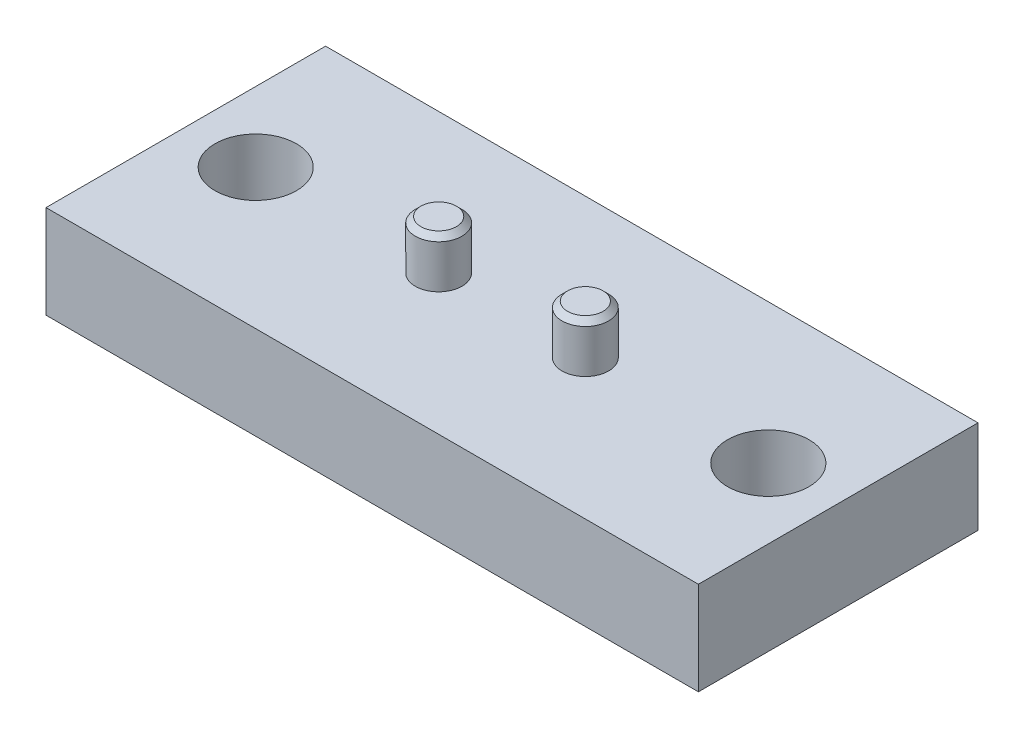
ISO-10303-21;
HEADER;
FILE_DESCRIPTION(('STEP AP214'),'2;1');
FILE_NAME('part.step','',(''),(''),'','','');
FILE_SCHEMA(('AUTOMOTIVE_DESIGN { 1 0 10303 214 1 1 1 1 }'));
ENDSEC;
DATA;
#1=APPLICATION_CONTEXT('core data for automotive mechanical design processes');
#2=APPLICATION_PROTOCOL_DEFINITION('international standard','automotive_design',2000,#1);
#3=PRODUCT_CONTEXT('',#1,'mechanical');
#4=PRODUCT('Part','Part','',(#3));
#5=PRODUCT_RELATED_PRODUCT_CATEGORY('part','',(#4));
#6=PRODUCT_DEFINITION_FORMATION('','',#4);
#7=PRODUCT_DEFINITION_CONTEXT('part definition',#1,'design');
#8=PRODUCT_DEFINITION('design','',#6,#7);
#9=PRODUCT_DEFINITION_SHAPE('','',#8);
#10=(LENGTH_UNIT() NAMED_UNIT(*) SI_UNIT(.MILLI.,.METRE.));
#11=(NAMED_UNIT(*) PLANE_ANGLE_UNIT() SI_UNIT($,.RADIAN.));
#12=(NAMED_UNIT(*) SI_UNIT($,.STERADIAN.) SOLID_ANGLE_UNIT());
#13=UNCERTAINTY_MEASURE_WITH_UNIT(LENGTH_MEASURE(1.E-05),#10,'distance_accuracy_value','');
#14=(GEOMETRIC_REPRESENTATION_CONTEXT(3) GLOBAL_UNCERTAINTY_ASSIGNED_CONTEXT((#13)) GLOBAL_UNIT_ASSIGNED_CONTEXT((#10,
#11,#12)) REPRESENTATION_CONTEXT('',''));
#15=CARTESIAN_POINT('',(0.,0.,0.));
#16=DIRECTION('',(0.,0.,1.));
#17=DIRECTION('',(1.,0.,0.));
#18=AXIS2_PLACEMENT_3D('',#15,#16,#17);
#19=CARTESIAN_POINT('',(-44.45,-12.7,-19.05));
#20=DIRECTION('',(0.,0.,1.));
#21=DIRECTION('',(-1.,0.,0.));
#22=AXIS2_PLACEMENT_3D('',#19,#20,#21);
#23=PLANE('',#22);
#24=DIRECTION('',(1.,0.,0.));
#25=VECTOR('',#24,1.);
#26=CARTESIAN_POINT('',(-44.45,0.,-19.05));
#27=LINE('',#26,#25);
#28=CARTESIAN_POINT('',(-44.45,0.,-19.05));
#29=VERTEX_POINT('',#28);
#30=CARTESIAN_POINT('',(44.45,0.,-19.05));
#31=VERTEX_POINT('',#30);
#32=EDGE_CURVE('E352',#29,#31,#27,.T.);
#33=ORIENTED_EDGE('',*,*,#32,.T.);
#34=DIRECTION('',(0.,1.,0.));
#35=VECTOR('',#34,1.);
#36=CARTESIAN_POINT('',(44.45,-12.7,-19.05));
#37=LINE('',#36,#35);
#38=CARTESIAN_POINT('',(44.45,-12.7,-19.05));
#39=VERTEX_POINT('',#38);
#40=EDGE_CURVE('E370',#39,#31,#37,.T.);
#41=ORIENTED_EDGE('',*,*,#40,.F.);
#42=DIRECTION('',(1.,0.,0.));
#43=VECTOR('',#42,1.);
#44=CARTESIAN_POINT('',(-44.45,-12.7,-19.05));
#45=LINE('',#44,#43);
#46=CARTESIAN_POINT('',(-44.45,-12.7,-19.05));
#47=VERTEX_POINT('',#46);
#48=EDGE_CURVE('E360',#47,#39,#45,.T.);
#49=ORIENTED_EDGE('',*,*,#48,.F.);
#50=DIRECTION('',(0.,1.,0.));
#51=VECTOR('',#50,1.);
#52=CARTESIAN_POINT('',(-44.45,-12.7,-19.05));
#53=LINE('',#52,#51);
#54=EDGE_CURVE('E253',#47,#29,#53,.T.);
#55=ORIENTED_EDGE('',*,*,#54,.T.);
#56=EDGE_LOOP('',(#33,#41,#49,#55));
#57=FACE_BOUND('',#56,.T.);
#58=ADVANCED_FACE('F14',(#57),#23,.F.);
#59=CARTESIAN_POINT('',(44.45,-12.7,19.05));
#60=DIRECTION('',(-1.,0.,0.));
#61=DIRECTION('',(0.,0.,-1.));
#62=AXIS2_PLACEMENT_3D('',#59,#60,#61);
#63=PLANE('',#62);
#64=DIRECTION('',(0.,0.,1.));
#65=VECTOR('',#64,1.);
#66=CARTESIAN_POINT('',(44.45,0.,19.05));
#67=LINE('',#66,#65);
#68=CARTESIAN_POINT('',(44.45,0.,19.05));
#69=VERTEX_POINT('',#68);
#70=EDGE_CURVE('E354',#31,#69,#67,.T.);
#71=ORIENTED_EDGE('',*,*,#70,.T.);
#72=DIRECTION('',(0.,1.,0.));
#73=VECTOR('',#72,1.);
#74=CARTESIAN_POINT('',(44.45,-12.7,19.05));
#75=LINE('',#74,#73);
#76=CARTESIAN_POINT('',(44.45,-12.7,19.05));
#77=VERTEX_POINT('',#76);
#78=EDGE_CURVE('E367',#77,#69,#75,.T.);
#79=ORIENTED_EDGE('',*,*,#78,.F.);
#80=DIRECTION('',(0.,0.,1.));
#81=VECTOR('',#80,1.);
#82=CARTESIAN_POINT('',(44.45,-12.7,19.05));
#83=LINE('',#82,#81);
#84=EDGE_CURVE('E34',#39,#77,#83,.T.);
#85=ORIENTED_EDGE('',*,*,#84,.F.);
#86=ORIENTED_EDGE('',*,*,#40,.T.);
#87=EDGE_LOOP('',(#71,#79,#85,#86));
#88=FACE_BOUND('',#87,.T.);
#89=ADVANCED_FACE('F491',(#88),#63,.F.);
#90=CARTESIAN_POINT('',(-44.45,-12.7,19.05));
#91=DIRECTION('',(0.,0.,-1.));
#92=DIRECTION('',(1.,0.,0.));
#93=AXIS2_PLACEMENT_3D('',#90,#91,#92);
#94=PLANE('',#93);
#95=DIRECTION('',(-1.,0.,0.));
#96=VECTOR('',#95,1.);
#97=CARTESIAN_POINT('',(-44.45,0.,19.05));
#98=LINE('',#97,#96);
#99=CARTESIAN_POINT('',(-44.45,0.,19.05));
#100=VERTEX_POINT('',#99);
#101=EDGE_CURVE('E356',#69,#100,#98,.T.);
#102=ORIENTED_EDGE('',*,*,#101,.T.);
#103=DIRECTION('',(0.,1.,0.));
#104=VECTOR('',#103,1.);
#105=CARTESIAN_POINT('',(-44.45,-12.7,19.05));
#106=LINE('',#105,#104);
#107=CARTESIAN_POINT('',(-44.45,-12.7,19.05));
#108=VERTEX_POINT('',#107);
#109=EDGE_CURVE('E364',#108,#100,#106,.T.);
#110=ORIENTED_EDGE('',*,*,#109,.F.);
#111=DIRECTION('',(-1.,0.,0.));
#112=VECTOR('',#111,1.);
#113=CARTESIAN_POINT('',(-44.45,-12.7,19.05));
#114=LINE('',#113,#112);
#115=EDGE_CURVE('E29',#77,#108,#114,.T.);
#116=ORIENTED_EDGE('',*,*,#115,.F.);
#117=ORIENTED_EDGE('',*,*,#78,.T.);
#118=EDGE_LOOP('',(#102,#110,#116,#117));
#119=FACE_BOUND('',#118,.T.);
#120=ADVANCED_FACE('F488',(#119),#94,.F.);
#121=CARTESIAN_POINT('',(-44.45,-12.7,19.05));
#122=DIRECTION('',(1.,0.,0.));
#123=DIRECTION('',(0.,0.,1.));
#124=AXIS2_PLACEMENT_3D('',#121,#122,#123);
#125=PLANE('',#124);
#126=DIRECTION('',(0.,0.,-1.));
#127=VECTOR('',#126,1.);
#128=CARTESIAN_POINT('',(-44.45,0.,19.05));
#129=LINE('',#128,#127);
#130=EDGE_CURVE('E349',#100,#29,#129,.T.);
#131=ORIENTED_EDGE('',*,*,#130,.T.);
#132=ORIENTED_EDGE('',*,*,#54,.F.);
#133=DIRECTION('',(0.,0.,-1.));
#134=VECTOR('',#133,1.);
#135=CARTESIAN_POINT('',(-44.45,-12.7,19.05));
#136=LINE('',#135,#134);
#137=EDGE_CURVE('E358',#108,#47,#136,.T.);
#138=ORIENTED_EDGE('',*,*,#137,.F.);
#139=ORIENTED_EDGE('',*,*,#109,.T.);
#140=EDGE_LOOP('',(#131,#132,#138,#139));
#141=FACE_BOUND('',#140,.T.);
#142=ADVANCED_FACE('F16',(#141),#125,.F.);
#143=CARTESIAN_POINT('',(34.925,-12.7,0.));
#144=DIRECTION('',(0.,-1.,0.));
#145=DIRECTION('',(0.,0.,-1.));
#146=AXIS2_PLACEMENT_3D('',#143,#144,#145);
#147=CYLINDRICAL_SURFACE('',#146,5.5499);
#148=CARTESIAN_POINT('',(34.925,0.,0.));
#149=DIRECTION('',(0.,-1.,0.));
#150=DIRECTION('',(0.,0.,-1.));
#151=AXIS2_PLACEMENT_3D('',#148,#149,#150);
#152=CIRCLE('',#151,5.5499);
#153=CARTESIAN_POINT('',(34.925,0.,-5.54990000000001));
#154=VERTEX_POINT('',#153);
#155=EDGE_CURVE('E340',#154,#154,#152,.T.);
#156=ORIENTED_EDGE('',*,*,#155,.F.);
#157=EDGE_LOOP('',(#156));
#158=FACE_BOUND('',#157,.T.);
#159=CARTESIAN_POINT('',(34.925,-12.7,0.));
#160=DIRECTION('',(0.,-1.,0.));
#161=DIRECTION('',(0.,0.,-1.));
#162=AXIS2_PLACEMENT_3D('',#159,#160,#161);
#163=CIRCLE('',#162,5.5499);
#164=CARTESIAN_POINT('',(34.925,-12.7,-5.54990000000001));
#165=VERTEX_POINT('',#164);
#166=EDGE_CURVE('E337',#165,#165,#163,.T.);
#167=ORIENTED_EDGE('',*,*,#166,.T.);
#168=EDGE_LOOP('',(#167));
#169=FACE_BOUND('',#168,.T.);
#170=ADVANCED_FACE('F469',(#158,#169),#147,.F.);
#171=CARTESIAN_POINT('',(-34.925,-12.7,0.));
#172=DIRECTION('',(0.,-1.,0.));
#173=DIRECTION('',(0.,0.,-1.));
#174=AXIS2_PLACEMENT_3D('',#171,#172,#173);
#175=CYLINDRICAL_SURFACE('',#174,5.5499);
#176=CARTESIAN_POINT('',(-34.925,0.,0.));
#177=DIRECTION('',(0.,-1.,0.));
#178=DIRECTION('',(0.,0.,-1.));
#179=AXIS2_PLACEMENT_3D('',#176,#177,#178);
#180=CIRCLE('',#179,5.5499);
#181=CARTESIAN_POINT('',(-34.925,0.,-5.54989999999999));
#182=VERTEX_POINT('',#181);
#183=EDGE_CURVE('E334',#182,#182,#180,.T.);
#184=ORIENTED_EDGE('',*,*,#183,.F.);
#185=EDGE_LOOP('',(#184));
#186=FACE_BOUND('',#185,.T.);
#187=CARTESIAN_POINT('',(-34.925,-12.7,0.));
#188=DIRECTION('',(0.,-1.,0.));
#189=DIRECTION('',(0.,0.,-1.));
#190=AXIS2_PLACEMENT_3D('',#187,#188,#189);
#191=CIRCLE('',#190,5.5499);
#192=CARTESIAN_POINT('',(-34.925,-12.7,-5.54989999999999));
#193=VERTEX_POINT('',#192);
#194=EDGE_CURVE('E331',#193,#193,#191,.T.);
#195=ORIENTED_EDGE('',*,*,#194,.T.);
#196=EDGE_LOOP('',(#195));
#197=FACE_BOUND('',#196,.T.);
#198=ADVANCED_FACE('F466',(#186,#197),#175,.F.);
#199=CARTESIAN_POINT('',(-44.45,0.,19.05));
#200=DIRECTION('',(0.,-1.,0.));
#201=DIRECTION('',(0.,0.,-1.));
#202=AXIS2_PLACEMENT_3D('',#199,#200,#201);
#203=PLANE('',#202);
#204=CARTESIAN_POINT('',(9.9949,0.,0.));
#205=DIRECTION('',(0.,-1.,0.));
#206=DIRECTION('',(1.,0.,0.));
#207=AXIS2_PLACEMENT_3D('',#204,#205,#206);
#208=CIRCLE('',#207,3.175);
#209=CARTESIAN_POINT('',(13.1699,0.,0.));
#210=VERTEX_POINT('',#209);
#211=EDGE_CURVE('E9',#210,#210,#208,.T.);
#212=ORIENTED_EDGE('',*,*,#211,.T.);
#213=EDGE_LOOP('',(#212));
#214=FACE_BOUND('',#213,.T.);
#215=CARTESIAN_POINT('',(-9.9949,0.,0.));
#216=DIRECTION('',(0.,-1.,0.));
#217=DIRECTION('',(1.,0.,0.));
#218=AXIS2_PLACEMENT_3D('',#215,#216,#217);
#219=CIRCLE('',#218,3.175);
#220=CARTESIAN_POINT('',(-6.8199,0.,0.));
#221=VERTEX_POINT('',#220);
#222=EDGE_CURVE('E22',#221,#221,#219,.T.);
#223=ORIENTED_EDGE('',*,*,#222,.T.);
#224=EDGE_LOOP('',(#223));
#225=FACE_BOUND('',#224,.T.);
#226=ORIENTED_EDGE('',*,*,#183,.T.);
#227=EDGE_LOOP('',(#226));
#228=FACE_BOUND('',#227,.T.);
#229=ORIENTED_EDGE('',*,*,#155,.T.);
#230=EDGE_LOOP('',(#229));
#231=FACE_BOUND('',#230,.T.);
#232=ORIENTED_EDGE('',*,*,#130,.F.);
#233=ORIENTED_EDGE('',*,*,#101,.F.);
#234=ORIENTED_EDGE('',*,*,#70,.F.);
#235=ORIENTED_EDGE('',*,*,#32,.F.);
#236=EDGE_LOOP('',(#232,#233,#234,#235));
#237=FACE_BOUND('',#236,.T.);
#238=ADVANCED_FACE('F377',(#214,#225,#228,#231,#237),#203,.F.);
#239=CARTESIAN_POINT('',(-44.45,-12.7,19.05));
#240=DIRECTION('',(0.,-1.,0.));
#241=DIRECTION('',(0.,0.,-1.));
#242=AXIS2_PLACEMENT_3D('',#239,#240,#241);
#243=PLANE('',#242);
#244=ORIENTED_EDGE('',*,*,#194,.F.);
#245=EDGE_LOOP('',(#244));
#246=FACE_BOUND('',#245,.T.);
#247=ORIENTED_EDGE('',*,*,#166,.F.);
#248=EDGE_LOOP('',(#247));
#249=FACE_BOUND('',#248,.T.);
#250=CARTESIAN_POINT('',(-9.9949,-12.7,0.));
#251=DIRECTION('',(0.,-1.,0.));
#252=DIRECTION('',(0.,0.,-1.));
#253=AXIS2_PLACEMENT_3D('',#250,#251,#252);
#254=CIRCLE('',#253,7.1247);
#255=CARTESIAN_POINT('',(-9.9949,-12.7,-7.1247));
#256=VERTEX_POINT('',#255);
#257=EDGE_CURVE('E343',#256,#256,#254,.T.);
#258=ORIENTED_EDGE('',*,*,#257,.F.);
#259=EDGE_LOOP('',(#258));
#260=FACE_BOUND('',#259,.T.);
#261=CARTESIAN_POINT('',(9.9949,-12.7,0.));
#262=DIRECTION('',(0.,-1.,0.));
#263=DIRECTION('',(0.,0.,-1.));
#264=AXIS2_PLACEMENT_3D('',#261,#262,#263);
#265=CIRCLE('',#264,7.1247);
#266=CARTESIAN_POINT('',(9.9949,-12.7,-7.1247));
#267=VERTEX_POINT('',#266);
#268=EDGE_CURVE('E346',#267,#267,#265,.T.);
#269=ORIENTED_EDGE('',*,*,#268,.F.);
#270=EDGE_LOOP('',(#269));
#271=FACE_BOUND('',#270,.T.);
#272=ORIENTED_EDGE('',*,*,#137,.T.);
#273=ORIENTED_EDGE('',*,*,#48,.T.);
#274=ORIENTED_EDGE('',*,*,#84,.T.);
#275=ORIENTED_EDGE('',*,*,#115,.T.);
#276=EDGE_LOOP('',(#272,#273,#274,#275));
#277=FACE_BOUND('',#276,.T.);
#278=ADVANCED_FACE('F477',(#246,#249,#260,#271,#277),#243,.T.);
#279=CARTESIAN_POINT('',(-9.9949,-12.7,0.));
#280=DIRECTION('',(0.,-1.,0.));
#281=DIRECTION('',(0.,0.,-1.));
#282=AXIS2_PLACEMENT_3D('',#279,#280,#281);
#283=CONICAL_SURFACE('',#282,7.1247,0.715584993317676);
#284=ORIENTED_EDGE('',*,*,#257,.T.);
#285=EDGE_LOOP('',(#284));
#286=FACE_BOUND('',#285,.T.);
#287=CARTESIAN_POINT('',(-9.9949,-12.2617096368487,0.));
#288=DIRECTION('',(0.,-1.,0.));
#289=DIRECTION('',(-1.,0.,0.));
#290=AXIS2_PLACEMENT_3D('',#287,#288,#289);
#291=CIRCLE('',#290,6.7437);
#292=CARTESIAN_POINT('',(-16.7386,-12.2617096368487,0.));
#293=VERTEX_POINT('',#292);
#294=EDGE_CURVE('E249',#293,#293,#291,.T.);
#295=ORIENTED_EDGE('',*,*,#294,.F.);
#296=EDGE_LOOP('',(#295));
#297=FACE_BOUND('',#296,.T.);
#298=ADVANCED_FACE('F474',(#286,#297),#283,.F.);
#299=CARTESIAN_POINT('',(9.9949,-12.7,0.));
#300=DIRECTION('',(0.,-1.,0.));
#301=DIRECTION('',(0.,0.,-1.));
#302=AXIS2_PLACEMENT_3D('',#299,#300,#301);
#303=CONICAL_SURFACE('',#302,7.1247,0.715584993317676);
#304=ORIENTED_EDGE('',*,*,#268,.T.);
#305=EDGE_LOOP('',(#304));
#306=FACE_BOUND('',#305,.T.);
#307=CARTESIAN_POINT('',(9.9949,-12.2617096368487,0.));
#308=DIRECTION('',(0.,-1.,0.));
#309=DIRECTION('',(1.,0.,0.));
#310=AXIS2_PLACEMENT_3D('',#307,#308,#309);
#311=CIRCLE('',#310,6.7437);
#312=CARTESIAN_POINT('',(16.7386,-12.2617096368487,0.));
#313=VERTEX_POINT('',#312);
#314=EDGE_CURVE('E252',#313,#313,#311,.T.);
#315=ORIENTED_EDGE('',*,*,#314,.F.);
#316=EDGE_LOOP('',(#315));
#317=FACE_BOUND('',#316,.T.);
#318=ADVANCED_FACE('F449',(#306,#317),#303,.F.);
#319=CARTESIAN_POINT('',(9.9949,-9.56930963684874,0.));
#320=DIRECTION('',(0.,-1.,0.));
#321=DIRECTION('',(1.,0.,0.));
#322=AXIS2_PLACEMENT_3D('',#319,#320,#321);
#323=CONICAL_SURFACE('',#322,1.9812,1.0471975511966);
#324=CARTESIAN_POINT('',(9.9949,-8.42546328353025,0.));
#325=VERTEX_POINT('',#324);
#326=VERTEX_LOOP('',#325);
#327=FACE_BOUND('',#326,.T.);
#328=CARTESIAN_POINT('',(9.9949,-9.56930963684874,0.));
#329=DIRECTION('',(0.,-1.,0.));
#330=DIRECTION('',(1.,0.,0.));
#331=AXIS2_PLACEMENT_3D('',#328,#329,#330);
#332=CIRCLE('',#331,1.9812);
#333=CARTESIAN_POINT('',(11.9761,-9.56930963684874,0.));
#334=VERTEX_POINT('',#333);
#335=CARTESIAN_POINT('',(10.9855,-9.56930963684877,1.71576952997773));
#336=VERTEX_POINT('',#335);
#337=EDGE_CURVE('E316',#334,#336,#332,.T.);
#338=ORIENTED_EDGE('',*,*,#337,.T.);
#339=CARTESIAN_POINT('',(9.0043,-9.56930963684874,1.71576952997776));
#340=VERTEX_POINT('',#339);
#341=EDGE_CURVE('E320',#336,#340,#332,.T.);
#342=ORIENTED_EDGE('',*,*,#341,.T.);
#343=CARTESIAN_POINT('',(8.01370000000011,-9.56930963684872,0.));
#344=VERTEX_POINT('',#343);
#345=EDGE_CURVE('E946',#340,#344,#332,.T.);
#346=ORIENTED_EDGE('',*,*,#345,.T.);
#347=CARTESIAN_POINT('',(9.0043,-9.56930963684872,-1.71576952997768));
#348=VERTEX_POINT('',#347);
#349=EDGE_CURVE('E945',#344,#348,#332,.T.);
#350=ORIENTED_EDGE('',*,*,#349,.T.);
#351=CARTESIAN_POINT('',(10.9855000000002,-9.56930963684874,-1.71576952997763));
#352=VERTEX_POINT('',#351);
#353=EDGE_CURVE('E942',#348,#352,#332,.T.);
#354=ORIENTED_EDGE('',*,*,#353,.T.);
#355=EDGE_CURVE('E315',#352,#334,#332,.T.);
#356=ORIENTED_EDGE('',*,*,#355,.T.);
#357=EDGE_LOOP('',(#338,#342,#346,#350,#354,#356));
#358=FACE_BOUND('',#357,.T.);
#359=ADVANCED_FACE('F446',(#327,#358),#323,.F.);
#360=CARTESIAN_POINT('',(8.01370000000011,-9.56930963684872,-1.14384635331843));
#361=DIRECTION('',(0.,1.,0.));
#362=DIRECTION('',(-1.,0.,0.));
#363=AXIS2_PLACEMENT_3D('',#360,#361,#362);
#364=PLANE('',#363);
#365=DIRECTION('',(0.,0.,-1.));
#366=VECTOR('',#365,1.);
#367=CARTESIAN_POINT('',(11.9761000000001,-9.56930963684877,1.14384635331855));
#368=LINE('',#367,#366);
#369=CARTESIAN_POINT('',(11.9761000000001,-9.56930963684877,1.14384635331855));
#370=VERTEX_POINT('',#369);
#371=EDGE_CURVE('E290',#370,#334,#368,.T.);
#372=ORIENTED_EDGE('',*,*,#371,.F.);
#373=DIRECTION('',(0.866025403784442,0.,-0.5));
#374=VECTOR('',#373,1.);
#375=CARTESIAN_POINT('',(9.9949,-9.56930963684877,2.28769270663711));
#376=LINE('',#375,#374);
#377=EDGE_CURVE('E285',#336,#370,#376,.T.);
#378=ORIENTED_EDGE('',*,*,#377,.F.);
#379=ORIENTED_EDGE('',*,*,#337,.F.);
#380=EDGE_LOOP('',(#372,#378,#379));
#381=FACE_BOUND('',#380,.T.);
#382=ADVANCED_FACE('F448',(#381),#364,.F.);
#383=CARTESIAN_POINT('',(9.9949,-9.56930963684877,2.28769270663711));
#384=VERTEX_POINT('',#383);
#385=EDGE_CURVE('E286',#384,#336,#376,.T.);
#386=ORIENTED_EDGE('',*,*,#385,.F.);
#387=DIRECTION('',(0.866025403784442,0.,0.5));
#388=VECTOR('',#387,1.);
#389=CARTESIAN_POINT('',(8.0137,-9.56930963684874,1.14384635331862));
#390=LINE('',#389,#388);
#391=EDGE_CURVE('E281',#340,#384,#390,.T.);
#392=ORIENTED_EDGE('',*,*,#391,.F.);
#393=ORIENTED_EDGE('',*,*,#341,.F.);
#394=EDGE_LOOP('',(#386,#392,#393));
#395=FACE_BOUND('',#394,.T.);
#396=ADVANCED_FACE('F825',(#395),#364,.F.);
#397=CARTESIAN_POINT('',(8.0137,-9.56930963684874,1.14384635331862));
#398=VERTEX_POINT('',#397);
#399=EDGE_CURVE('E282',#398,#340,#390,.T.);
#400=ORIENTED_EDGE('',*,*,#399,.F.);
#401=DIRECTION('',(0.,0.,1.));
#402=VECTOR('',#401,1.);
#403=CARTESIAN_POINT('',(8.01370000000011,-9.56930963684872,-1.14384635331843));
#404=LINE('',#403,#402);
#405=EDGE_CURVE('E278',#344,#398,#404,.T.);
#406=ORIENTED_EDGE('',*,*,#405,.F.);
#407=ORIENTED_EDGE('',*,*,#345,.F.);
#408=EDGE_LOOP('',(#400,#406,#407));
#409=FACE_BOUND('',#408,.T.);
#410=ADVANCED_FACE('F418',(#409),#364,.F.);
#411=CARTESIAN_POINT('',(8.01370000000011,-9.56930963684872,-1.14384635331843));
#412=VERTEX_POINT('',#411);
#413=EDGE_CURVE('E279',#412,#344,#404,.T.);
#414=ORIENTED_EDGE('',*,*,#413,.F.);
#415=DIRECTION('',(-0.866025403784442,0.,0.5));
#416=VECTOR('',#415,1.);
#417=CARTESIAN_POINT('',(9.9949,-9.56930963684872,-2.28769270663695));
#418=LINE('',#417,#416);
#419=EDGE_CURVE('E274',#348,#412,#418,.T.);
#420=ORIENTED_EDGE('',*,*,#419,.F.);
#421=ORIENTED_EDGE('',*,*,#349,.F.);
#422=EDGE_LOOP('',(#414,#420,#421));
#423=FACE_BOUND('',#422,.T.);
#424=ADVANCED_FACE('F414',(#423),#364,.F.);
#425=CARTESIAN_POINT('',(9.9949,-9.56930963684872,-2.28769270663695));
#426=VERTEX_POINT('',#425);
#427=EDGE_CURVE('E275',#426,#348,#418,.T.);
#428=ORIENTED_EDGE('',*,*,#427,.F.);
#429=DIRECTION('',(-0.866025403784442,0.,-0.5));
#430=VECTOR('',#429,1.);
#431=CARTESIAN_POINT('',(11.9761000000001,-9.56930963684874,-1.14384635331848));
#432=LINE('',#431,#430);
#433=EDGE_CURVE('E293',#352,#426,#432,.T.);
#434=ORIENTED_EDGE('',*,*,#433,.F.);
#435=ORIENTED_EDGE('',*,*,#353,.F.);
#436=EDGE_LOOP('',(#428,#434,#435));
#437=FACE_BOUND('',#436,.T.);
#438=ADVANCED_FACE('F417',(#437),#364,.F.);
#439=CARTESIAN_POINT('',(11.9761000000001,-9.56930963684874,-1.14384635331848));
#440=VERTEX_POINT('',#439);
#441=EDGE_CURVE('E294',#440,#352,#432,.T.);
#442=ORIENTED_EDGE('',*,*,#441,.F.);
#443=EDGE_CURVE('E289',#334,#440,#368,.T.);
#444=ORIENTED_EDGE('',*,*,#443,.F.);
#445=ORIENTED_EDGE('',*,*,#355,.F.);
#446=EDGE_LOOP('',(#442,#444,#445));
#447=FACE_BOUND('',#446,.T.);
#448=ADVANCED_FACE('F430',(#447),#364,.F.);
#449=CARTESIAN_POINT('',(11.9761000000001,-9.56930963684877,1.14384635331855));
#450=DIRECTION('',(-1.,0.,0.));
#451=DIRECTION('',(0.,-1.,0.));
#452=AXIS2_PLACEMENT_3D('',#449,#450,#451);
#453=PLANE('',#452);
#454=DIRECTION('',(0.,0.,-1.));
#455=VECTOR('',#454,1.);
#456=CARTESIAN_POINT('',(11.9761,-12.3887096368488,1.14384635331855));
#457=LINE('',#456,#455);
#458=CARTESIAN_POINT('',(11.9761,-12.3887096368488,1.14384635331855));
#459=VERTEX_POINT('',#458);
#460=CARTESIAN_POINT('',(11.9761000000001,-12.3887096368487,-1.14384635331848));
#461=VERTEX_POINT('',#460);
#462=EDGE_CURVE('E268',#459,#461,#457,.T.);
#463=ORIENTED_EDGE('',*,*,#462,.F.);
#464=DIRECTION('',(0.,-1.,0.));
#465=VECTOR('',#464,1.);
#466=CARTESIAN_POINT('',(11.9761000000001,-9.56930963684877,1.14384635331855));
#467=LINE('',#466,#465);
#468=EDGE_CURVE('E303',#370,#459,#467,.T.);
#469=ORIENTED_EDGE('',*,*,#468,.F.);
#470=ORIENTED_EDGE('',*,*,#371,.T.);
#471=ORIENTED_EDGE('',*,*,#443,.T.);
#472=DIRECTION('',(0.,-1.,0.));
#473=VECTOR('',#472,1.);
#474=CARTESIAN_POINT('',(11.9761000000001,-9.56930963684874,-1.14384635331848));
#475=LINE('',#474,#473);
#476=EDGE_CURVE('E300',#440,#461,#475,.T.);
#477=ORIENTED_EDGE('',*,*,#476,.T.);
#478=EDGE_LOOP('',(#463,#469,#470,#471,#477));
#479=FACE_BOUND('',#478,.T.);
#480=ADVANCED_FACE('F426',(#479),#453,.T.);
#481=CARTESIAN_POINT('',(9.9949,-9.56930963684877,2.28769270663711));
#482=DIRECTION('',(-0.5,0.,-0.866025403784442));
#483=DIRECTION('',(-0.866025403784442,0.,0.5));
#484=AXIS2_PLACEMENT_3D('',#481,#482,#483);
#485=PLANE('',#484);
#486=DIRECTION('',(0.866025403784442,0.,-0.5));
#487=VECTOR('',#486,1.);
#488=CARTESIAN_POINT('',(9.9949,-12.3887096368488,2.28769270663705));
#489=LINE('',#488,#487);
#490=CARTESIAN_POINT('',(9.9949,-12.3887096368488,2.28769270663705));
#491=VERTEX_POINT('',#490);
#492=EDGE_CURVE('E265',#491,#459,#489,.T.);
#493=ORIENTED_EDGE('',*,*,#492,.F.);
#494=DIRECTION('',(0.,-1.,0.));
#495=VECTOR('',#494,1.);
#496=CARTESIAN_POINT('',(9.9949,-9.56930963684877,2.28769270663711));
#497=LINE('',#496,#495);
#498=EDGE_CURVE('E306',#384,#491,#497,.T.);
#499=ORIENTED_EDGE('',*,*,#498,.F.);
#500=ORIENTED_EDGE('',*,*,#385,.T.);
#501=ORIENTED_EDGE('',*,*,#377,.T.);
#502=ORIENTED_EDGE('',*,*,#468,.T.);
#503=EDGE_LOOP('',(#493,#499,#500,#501,#502));
#504=FACE_BOUND('',#503,.T.);
#505=ADVANCED_FACE('F429',(#504),#485,.T.);
#506=CARTESIAN_POINT('',(8.0137,-9.56930963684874,1.14384635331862));
#507=DIRECTION('',(0.5,0.,-0.866025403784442));
#508=DIRECTION('',(-0.866025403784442,0.,-0.5));
#509=AXIS2_PLACEMENT_3D('',#506,#507,#508);
#510=PLANE('',#509);
#511=DIRECTION('',(0.866025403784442,0.,0.5));
#512=VECTOR('',#511,1.);
#513=CARTESIAN_POINT('',(8.0137,-12.3887096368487,1.1438463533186));
#514=LINE('',#513,#512);
#515=CARTESIAN_POINT('',(8.0137,-12.3887096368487,1.1438463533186));
#516=VERTEX_POINT('',#515);
#517=EDGE_CURVE('E262',#516,#491,#514,.T.);
#518=ORIENTED_EDGE('',*,*,#517,.F.);
#519=DIRECTION('',(0.,-1.,0.));
#520=VECTOR('',#519,1.);
#521=CARTESIAN_POINT('',(8.0137,-9.56930963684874,1.14384635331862));
#522=LINE('',#521,#520);
#523=EDGE_CURVE('E309',#398,#516,#522,.T.);
#524=ORIENTED_EDGE('',*,*,#523,.F.);
#525=ORIENTED_EDGE('',*,*,#399,.T.);
#526=ORIENTED_EDGE('',*,*,#391,.T.);
#527=ORIENTED_EDGE('',*,*,#498,.T.);
#528=EDGE_LOOP('',(#518,#524,#525,#526,#527));
#529=FACE_BOUND('',#528,.T.);
#530=ADVANCED_FACE('F434',(#529),#510,.T.);
#531=CARTESIAN_POINT('',(8.01370000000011,-9.56930963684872,-1.14384635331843));
#532=DIRECTION('',(1.,0.,0.));
#533=DIRECTION('',(0.,1.,0.));
#534=AXIS2_PLACEMENT_3D('',#531,#532,#533);
#535=PLANE('',#534);
#536=DIRECTION('',(0.,0.,1.));
#537=VECTOR('',#536,1.);
#538=CARTESIAN_POINT('',(8.0137,-12.3887096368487,-1.14384635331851));
#539=LINE('',#538,#537);
#540=CARTESIAN_POINT('',(8.0137,-12.3887096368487,-1.14384635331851));
#541=VERTEX_POINT('',#540);
#542=EDGE_CURVE('E259',#541,#516,#539,.T.);
#543=ORIENTED_EDGE('',*,*,#542,.F.);
#544=DIRECTION('',(0.,-1.,0.));
#545=VECTOR('',#544,1.);
#546=CARTESIAN_POINT('',(8.01370000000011,-9.56930963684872,-1.14384635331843));
#547=LINE('',#546,#545);
#548=EDGE_CURVE('E312',#412,#541,#547,.T.);
#549=ORIENTED_EDGE('',*,*,#548,.F.);
#550=ORIENTED_EDGE('',*,*,#413,.T.);
#551=ORIENTED_EDGE('',*,*,#405,.T.);
#552=ORIENTED_EDGE('',*,*,#523,.T.);
#553=EDGE_LOOP('',(#543,#549,#550,#551,#552));
#554=FACE_BOUND('',#553,.T.);
#555=ADVANCED_FACE('F438',(#554),#535,.T.);
#556=CARTESIAN_POINT('',(9.9949,-9.56930963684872,-2.28769270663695));
#557=DIRECTION('',(0.5,0.,0.866025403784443));
#558=DIRECTION('',(0.866025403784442,0.,-0.5));
#559=AXIS2_PLACEMENT_3D('',#556,#557,#558);
#560=PLANE('',#559);
#561=DIRECTION('',(-0.866025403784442,0.,0.5));
#562=VECTOR('',#561,1.);
#563=CARTESIAN_POINT('',(9.9949,-12.3887096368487,-2.28769270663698));
#564=LINE('',#563,#562);
#565=CARTESIAN_POINT('',(9.9949,-12.3887096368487,-2.28769270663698));
#566=VERTEX_POINT('',#565);
#567=EDGE_CURVE('E256',#566,#541,#564,.T.);
#568=ORIENTED_EDGE('',*,*,#567,.F.);
#569=DIRECTION('',(0.,-1.,0.));
#570=VECTOR('',#569,1.);
#571=CARTESIAN_POINT('',(9.9949,-9.56930963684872,-2.28769270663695));
#572=LINE('',#571,#570);
#573=EDGE_CURVE('E297',#426,#566,#572,.T.);
#574=ORIENTED_EDGE('',*,*,#573,.F.);
#575=ORIENTED_EDGE('',*,*,#427,.T.);
#576=ORIENTED_EDGE('',*,*,#419,.T.);
#577=ORIENTED_EDGE('',*,*,#548,.T.);
#578=EDGE_LOOP('',(#568,#574,#575,#576,#577));
#579=FACE_BOUND('',#578,.T.);
#580=ADVANCED_FACE('F424',(#579),#560,.T.);
#581=CARTESIAN_POINT('',(11.9761000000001,-9.56930963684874,-1.14384635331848));
#582=DIRECTION('',(-0.5,0.,0.866025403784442));
#583=DIRECTION('',(0.866025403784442,0.,0.5));
#584=AXIS2_PLACEMENT_3D('',#581,#582,#583);
#585=PLANE('',#584);
#586=DIRECTION('',(-0.866025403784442,0.,-0.5));
#587=VECTOR('',#586,1.);
#588=CARTESIAN_POINT('',(11.9761000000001,-12.3887096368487,-1.14384635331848));
#589=LINE('',#588,#587);
#590=EDGE_CURVE('E271',#461,#566,#589,.T.);
#591=ORIENTED_EDGE('',*,*,#590,.F.);
#592=ORIENTED_EDGE('',*,*,#476,.F.);
#593=ORIENTED_EDGE('',*,*,#441,.T.);
#594=ORIENTED_EDGE('',*,*,#433,.T.);
#595=ORIENTED_EDGE('',*,*,#573,.T.);
#596=EDGE_LOOP('',(#591,#592,#593,#594,#595));
#597=FACE_BOUND('',#596,.T.);
#598=ADVANCED_FACE('F420',(#597),#585,.T.);
#599=CARTESIAN_POINT('',(9.9949,-12.3887096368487,0.));
#600=DIRECTION('',(0.,-1.,0.));
#601=DIRECTION('',(1.,0.,0.));
#602=AXIS2_PLACEMENT_3D('',#599,#600,#601);
#603=PLANE('',#602);
#604=CARTESIAN_POINT('',(9.9949,-12.3887096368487,0.));
#605=DIRECTION('',(0.,-1.,0.));
#606=DIRECTION('',(1.,0.,0.));
#607=AXIS2_PLACEMENT_3D('',#604,#605,#606);
#608=CIRCLE('',#607,6.7437);
#609=CARTESIAN_POINT('',(16.7386,-12.3887096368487,0.));
#610=VERTEX_POINT('',#609);
#611=EDGE_CURVE('E326',#610,#610,#608,.T.);
#612=ORIENTED_EDGE('',*,*,#611,.T.);
#613=EDGE_LOOP('',(#612));
#614=FACE_BOUND('',#613,.T.);
#615=ORIENTED_EDGE('',*,*,#590,.T.);
#616=ORIENTED_EDGE('',*,*,#567,.T.);
#617=ORIENTED_EDGE('',*,*,#542,.T.);
#618=ORIENTED_EDGE('',*,*,#517,.T.);
#619=ORIENTED_EDGE('',*,*,#492,.T.);
#620=ORIENTED_EDGE('',*,*,#462,.T.);
#621=EDGE_LOOP('',(#615,#616,#617,#618,#619,#620));
#622=FACE_BOUND('',#621,.T.);
#623=ADVANCED_FACE('F423',(#614,#622),#603,.T.);
#624=CARTESIAN_POINT('',(9.9949,-12.3887096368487,0.));
#625=DIRECTION('',(0.,-1.,0.));
#626=DIRECTION('',(1.,0.,0.));
#627=AXIS2_PLACEMENT_3D('',#624,#625,#626);
#628=CYLINDRICAL_SURFACE('',#627,6.7437);
#629=ORIENTED_EDGE('',*,*,#314,.T.);
#630=EDGE_LOOP('',(#629));
#631=FACE_BOUND('',#630,.T.);
#632=ORIENTED_EDGE('',*,*,#611,.F.);
#633=EDGE_LOOP('',(#632));
#634=FACE_BOUND('',#633,.T.);
#635=ADVANCED_FACE('F396',(#631,#634),#628,.T.);
#636=CARTESIAN_POINT('',(9.99490000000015,6.66129036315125,2.4193500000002));
#637=DIRECTION('',(0.,1.,0.));
#638=DIRECTION('',(-1.,0.,0.));
#639=AXIS2_PLACEMENT_3D('',#636,#637,#638);
#640=PLANE('',#639);
#641=CARTESIAN_POINT('',(9.99490000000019,6.6612903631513,0.));
#642=DIRECTION('',(0.,-1.,0.));
#643=DIRECTION('',(1.,0.,0.));
#644=AXIS2_PLACEMENT_3D('',#641,#642,#643);
#645=CIRCLE('',#644,2.41935);
#646=CARTESIAN_POINT('',(12.4142500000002,6.6612903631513,0.));
#647=VERTEX_POINT('',#646);
#648=EDGE_CURVE('E319',#647,#647,#645,.T.);
#649=ORIENTED_EDGE('',*,*,#648,.F.);
#650=EDGE_LOOP('',(#649));
#651=FACE_BOUND('',#650,.T.);
#652=ADVANCED_FACE('F385',(#651),#640,.T.);
#653=CARTESIAN_POINT('',(9.99490000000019,6.6612903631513,0.));
#654=DIRECTION('',(0.,-1.,0.));
#655=DIRECTION('',(1.,0.,0.));
#656=AXIS2_PLACEMENT_3D('',#653,#654,#655);
#657=CONICAL_SURFACE('',#656,2.41935,0.78539816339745);
#658=CARTESIAN_POINT('',(9.9949,5.9056403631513,0.));
#659=DIRECTION('',(0.,-1.,0.));
#660=DIRECTION('',(1.,0.,0.));
#661=AXIS2_PLACEMENT_3D('',#658,#659,#660);
#662=CIRCLE('',#661,3.175);
#663=CARTESIAN_POINT('',(13.1699,5.9056403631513,0.));
#664=VERTEX_POINT('',#663);
#665=EDGE_CURVE('E323',#664,#664,#662,.T.);
#666=ORIENTED_EDGE('',*,*,#665,.F.);
#667=EDGE_LOOP('',(#666));
#668=FACE_BOUND('',#667,.T.);
#669=ORIENTED_EDGE('',*,*,#648,.T.);
#670=EDGE_LOOP('',(#669));
#671=FACE_BOUND('',#670,.T.);
#672=ADVANCED_FACE('F395',(#668,#671),#657,.T.);
#673=CARTESIAN_POINT('',(9.9949,-12.3887096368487,0.));
#674=DIRECTION('',(0.,-1.,0.));
#675=DIRECTION('',(1.,0.,0.));
#676=AXIS2_PLACEMENT_3D('',#673,#674,#675);
#677=CYLINDRICAL_SURFACE('',#676,3.175);
#678=ORIENTED_EDGE('',*,*,#665,.T.);
#679=EDGE_LOOP('',(#678));
#680=FACE_BOUND('',#679,.T.);
#681=ORIENTED_EDGE('',*,*,#211,.F.);
#682=EDGE_LOOP('',(#681));
#683=FACE_BOUND('',#682,.T.);
#684=ADVANCED_FACE('F454',(#680,#683),#677,.T.);
#685=CARTESIAN_POINT('',(-9.9949,-9.56930963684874,0.));
#686=DIRECTION('',(0.,-1.,0.));
#687=DIRECTION('',(-1.,0.,0.));
#688=AXIS2_PLACEMENT_3D('',#685,#686,#687);
#689=CONICAL_SURFACE('',#688,1.9812,1.0471975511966);
#690=CARTESIAN_POINT('',(-9.9949,-8.42546328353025,0.));
#691=VERTEX_POINT('',#690);
#692=VERTEX_LOOP('',#691);
#693=FACE_BOUND('',#692,.T.);
#694=CARTESIAN_POINT('',(-9.9949,-9.56930963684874,0.));
#695=DIRECTION('',(0.,-1.,0.));
#696=DIRECTION('',(-1.,0.,0.));
#697=AXIS2_PLACEMENT_3D('',#694,#695,#696);
#698=CIRCLE('',#697,1.9812);
#699=CARTESIAN_POINT('',(-11.9761,-9.56930963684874,0.));
#700=VERTEX_POINT('',#699);
#701=CARTESIAN_POINT('',(-10.9855,-9.56930963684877,-1.71576952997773));
#702=VERTEX_POINT('',#701);
#703=EDGE_CURVE('E238',#700,#702,#698,.T.);
#704=ORIENTED_EDGE('',*,*,#703,.T.);
#705=CARTESIAN_POINT('',(-9.0043,-9.56930963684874,-1.71576952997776));
#706=VERTEX_POINT('',#705);
#707=EDGE_CURVE('E242',#702,#706,#698,.T.);
#708=ORIENTED_EDGE('',*,*,#707,.T.);
#709=CARTESIAN_POINT('',(-8.01370000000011,-9.56930963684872,0.));
#710=VERTEX_POINT('',#709);
#711=EDGE_CURVE('E971',#706,#710,#698,.T.);
#712=ORIENTED_EDGE('',*,*,#711,.T.);
#713=CARTESIAN_POINT('',(-9.0043,-9.56930963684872,1.71576952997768));
#714=VERTEX_POINT('',#713);
#715=EDGE_CURVE('E968',#710,#714,#698,.T.);
#716=ORIENTED_EDGE('',*,*,#715,.T.);
#717=CARTESIAN_POINT('',(-10.9855000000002,-9.56930963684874,1.71576952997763));
#718=VERTEX_POINT('',#717);
#719=EDGE_CURVE('E964',#714,#718,#698,.T.);
#720=ORIENTED_EDGE('',*,*,#719,.T.);
#721=EDGE_CURVE('E190',#718,#700,#698,.T.);
#722=ORIENTED_EDGE('',*,*,#721,.T.);
#723=EDGE_LOOP('',(#704,#708,#712,#716,#720,#722));
#724=FACE_BOUND('',#723,.T.);
#725=ADVANCED_FACE('F458',(#693,#724),#689,.F.);
#726=CARTESIAN_POINT('',(-8.01370000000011,-9.56930963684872,1.14384635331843));
#727=DIRECTION('',(0.,1.,0.));
#728=DIRECTION('',(1.,0.,0.));
#729=AXIS2_PLACEMENT_3D('',#726,#727,#728);
#730=PLANE('',#729);
#731=DIRECTION('',(0.,0.,1.));
#732=VECTOR('',#731,1.);
#733=CARTESIAN_POINT('',(-11.9761000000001,-9.56930963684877,-1.14384635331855));
#734=LINE('',#733,#732);
#735=CARTESIAN_POINT('',(-11.9761000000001,-9.56930963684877,-1.14384635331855));
#736=VERTEX_POINT('',#735);
#737=EDGE_CURVE('E219',#736,#700,#734,.T.);
#738=ORIENTED_EDGE('',*,*,#737,.F.);
#739=DIRECTION('',(-0.866025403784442,0.,0.5));
#740=VECTOR('',#739,1.);
#741=CARTESIAN_POINT('',(-9.9949,-9.56930963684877,-2.28769270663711));
#742=LINE('',#741,#740);
#743=EDGE_CURVE('E214',#702,#736,#742,.T.);
#744=ORIENTED_EDGE('',*,*,#743,.F.);
#745=ORIENTED_EDGE('',*,*,#703,.F.);
#746=EDGE_LOOP('',(#738,#744,#745));
#747=FACE_BOUND('',#746,.T.);
#748=ADVANCED_FACE('F500',(#747),#730,.F.);
#749=CARTESIAN_POINT('',(-9.9949,-9.56930963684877,-2.28769270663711));
#750=VERTEX_POINT('',#749);
#751=EDGE_CURVE('E215',#750,#702,#742,.T.);
#752=ORIENTED_EDGE('',*,*,#751,.F.);
#753=DIRECTION('',(-0.866025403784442,0.,-0.5));
#754=VECTOR('',#753,1.);
#755=CARTESIAN_POINT('',(-8.0137,-9.56930963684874,-1.14384635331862));
#756=LINE('',#755,#754);
#757=EDGE_CURVE('E210',#706,#750,#756,.T.);
#758=ORIENTED_EDGE('',*,*,#757,.F.);
#759=ORIENTED_EDGE('',*,*,#707,.F.);
#760=EDGE_LOOP('',(#752,#758,#759));
#761=FACE_BOUND('',#760,.T.);
#762=ADVANCED_FACE('F507',(#761),#730,.F.);
#763=CARTESIAN_POINT('',(-8.0137,-9.56930963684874,-1.14384635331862));
#764=VERTEX_POINT('',#763);
#765=EDGE_CURVE('E211',#764,#706,#756,.T.);
#766=ORIENTED_EDGE('',*,*,#765,.F.);
#767=DIRECTION('',(0.,0.,-1.));
#768=VECTOR('',#767,1.);
#769=CARTESIAN_POINT('',(-8.01370000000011,-9.56930963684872,1.14384635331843));
#770=LINE('',#769,#768);
#771=EDGE_CURVE('E207',#710,#764,#770,.T.);
#772=ORIENTED_EDGE('',*,*,#771,.F.);
#773=ORIENTED_EDGE('',*,*,#711,.F.);
#774=EDGE_LOOP('',(#766,#772,#773));
#775=FACE_BOUND('',#774,.T.);
#776=ADVANCED_FACE('F503',(#775),#730,.F.);
#777=CARTESIAN_POINT('',(-8.01370000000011,-9.56930963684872,1.14384635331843));
#778=VERTEX_POINT('',#777);
#779=EDGE_CURVE('E208',#778,#710,#770,.T.);
#780=ORIENTED_EDGE('',*,*,#779,.F.);
#781=DIRECTION('',(0.866025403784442,0.,-0.5));
#782=VECTOR('',#781,1.);
#783=CARTESIAN_POINT('',(-9.9949,-9.56930963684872,2.28769270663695));
#784=LINE('',#783,#782);
#785=EDGE_CURVE('E188',#714,#778,#784,.T.);
#786=ORIENTED_EDGE('',*,*,#785,.F.);
#787=ORIENTED_EDGE('',*,*,#715,.F.);
#788=EDGE_LOOP('',(#780,#786,#787));
#789=FACE_BOUND('',#788,.T.);
#790=ADVANCED_FACE('F411',(#789),#730,.F.);
#791=CARTESIAN_POINT('',(-9.9949,-9.56930963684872,2.28769270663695));
#792=VERTEX_POINT('',#791);
#793=EDGE_CURVE('E205',#792,#714,#784,.T.);
#794=ORIENTED_EDGE('',*,*,#793,.F.);
#795=DIRECTION('',(0.866025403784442,0.,0.5));
#796=VECTOR('',#795,1.);
#797=CARTESIAN_POINT('',(-11.9761000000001,-9.56930963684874,1.14384635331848));
#798=LINE('',#797,#796);
#799=EDGE_CURVE('E222',#718,#792,#798,.T.);
#800=ORIENTED_EDGE('',*,*,#799,.F.);
#801=ORIENTED_EDGE('',*,*,#719,.F.);
#802=EDGE_LOOP('',(#794,#800,#801));
#803=FACE_BOUND('',#802,.T.);
#804=ADVANCED_FACE('F520',(#803),#730,.F.);
#805=CARTESIAN_POINT('',(-11.9761000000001,-9.56930963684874,1.14384635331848));
#806=VERTEX_POINT('',#805);
#807=EDGE_CURVE('E223',#806,#718,#798,.T.);
#808=ORIENTED_EDGE('',*,*,#807,.F.);
#809=EDGE_CURVE('E218',#700,#806,#734,.T.);
#810=ORIENTED_EDGE('',*,*,#809,.F.);
#811=ORIENTED_EDGE('',*,*,#721,.F.);
#812=EDGE_LOOP('',(#808,#810,#811));
#813=FACE_BOUND('',#812,.T.);
#814=ADVANCED_FACE('F510',(#813),#730,.F.);
#815=CARTESIAN_POINT('',(-11.9761000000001,-9.56930963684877,-1.14384635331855));
#816=DIRECTION('',(1.,0.,0.));
#817=DIRECTION('',(0.,-1.,0.));
#818=AXIS2_PLACEMENT_3D('',#815,#816,#817);
#819=PLANE('',#818);
#820=DIRECTION('',(0.,0.,1.));
#821=VECTOR('',#820,1.);
#822=CARTESIAN_POINT('',(-11.9761,-12.3887096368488,-1.14384635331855));
#823=LINE('',#822,#821);
#824=CARTESIAN_POINT('',(-11.9761,-12.3887096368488,-1.14384635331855));
#825=VERTEX_POINT('',#824);
#826=CARTESIAN_POINT('',(-11.9761000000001,-12.3887096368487,1.14384635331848));
#827=VERTEX_POINT('',#826);
#828=EDGE_CURVE('E202',#825,#827,#823,.T.);
#829=ORIENTED_EDGE('',*,*,#828,.F.);
#830=DIRECTION('',(0.,-1.,0.));
#831=VECTOR('',#830,1.);
#832=CARTESIAN_POINT('',(-11.9761000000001,-9.56930963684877,-1.14384635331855));
#833=LINE('',#832,#831);
#834=EDGE_CURVE('E231',#736,#825,#833,.T.);
#835=ORIENTED_EDGE('',*,*,#834,.F.);
#836=ORIENTED_EDGE('',*,*,#737,.T.);
#837=ORIENTED_EDGE('',*,*,#809,.T.);
#838=DIRECTION('',(0.,-1.,0.));
#839=VECTOR('',#838,1.);
#840=CARTESIAN_POINT('',(-11.9761000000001,-9.56930963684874,1.14384635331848));
#841=LINE('',#840,#839);
#842=EDGE_CURVE('E228',#806,#827,#841,.T.);
#843=ORIENTED_EDGE('',*,*,#842,.T.);
#844=EDGE_LOOP('',(#829,#835,#836,#837,#843));
#845=FACE_BOUND('',#844,.T.);
#846=ADVANCED_FACE('F412',(#845),#819,.T.);
#847=CARTESIAN_POINT('',(-9.9949,-9.56930963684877,-2.28769270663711));
#848=DIRECTION('',(0.5,0.,0.866025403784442));
#849=DIRECTION('',(0.866025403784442,0.,-0.5));
#850=AXIS2_PLACEMENT_3D('',#847,#848,#849);
#851=PLANE('',#850);
#852=DIRECTION('',(-0.866025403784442,0.,0.5));
#853=VECTOR('',#852,1.);
#854=CARTESIAN_POINT('',(-9.9949,-12.3887096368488,-2.28769270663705));
#855=LINE('',#854,#853);
#856=CARTESIAN_POINT('',(-9.9949,-12.3887096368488,-2.28769270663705));
#857=VERTEX_POINT('',#856);
#858=EDGE_CURVE('E199',#857,#825,#855,.T.);
#859=ORIENTED_EDGE('',*,*,#858,.F.);
#860=DIRECTION('',(0.,-1.,0.));
#861=VECTOR('',#860,1.);
#862=CARTESIAN_POINT('',(-9.9949,-9.56930963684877,-2.28769270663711));
#863=LINE('',#862,#861);
#864=EDGE_CURVE('E234',#750,#857,#863,.T.);
#865=ORIENTED_EDGE('',*,*,#864,.F.);
#866=ORIENTED_EDGE('',*,*,#751,.T.);
#867=ORIENTED_EDGE('',*,*,#743,.T.);
#868=ORIENTED_EDGE('',*,*,#834,.T.);
#869=EDGE_LOOP('',(#859,#865,#866,#867,#868));
#870=FACE_BOUND('',#869,.T.);
#871=ADVANCED_FACE('F527',(#870),#851,.T.);
#872=CARTESIAN_POINT('',(-8.0137,-9.56930963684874,-1.14384635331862));
#873=DIRECTION('',(-0.5,0.,0.866025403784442));
#874=DIRECTION('',(0.866025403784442,0.,0.5));
#875=AXIS2_PLACEMENT_3D('',#872,#873,#874);
#876=PLANE('',#875);
#877=DIRECTION('',(-0.866025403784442,0.,-0.5));
#878=VECTOR('',#877,1.);
#879=CARTESIAN_POINT('',(-8.0137,-12.3887096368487,-1.1438463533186));
#880=LINE('',#879,#878);
#881=CARTESIAN_POINT('',(-8.0137,-12.3887096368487,-1.1438463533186));
#882=VERTEX_POINT('',#881);
#883=EDGE_CURVE('E179',#882,#857,#880,.T.);
#884=ORIENTED_EDGE('',*,*,#883,.F.);
#885=DIRECTION('',(0.,-1.,0.));
#886=VECTOR('',#885,1.);
#887=CARTESIAN_POINT('',(-8.0137,-9.56930963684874,-1.14384635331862));
#888=LINE('',#887,#886);
#889=EDGE_CURVE('E175',#764,#882,#888,.T.);
#890=ORIENTED_EDGE('',*,*,#889,.F.);
#891=ORIENTED_EDGE('',*,*,#765,.T.);
#892=ORIENTED_EDGE('',*,*,#757,.T.);
#893=ORIENTED_EDGE('',*,*,#864,.T.);
#894=EDGE_LOOP('',(#884,#890,#891,#892,#893));
#895=FACE_BOUND('',#894,.T.);
#896=ADVANCED_FACE('F531',(#895),#876,.T.);
#897=CARTESIAN_POINT('',(-8.01370000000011,-9.56930963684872,1.14384635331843));
#898=DIRECTION('',(-1.,0.,0.));
#899=DIRECTION('',(0.,1.,0.));
#900=AXIS2_PLACEMENT_3D('',#897,#898,#899);
#901=PLANE('',#900);
#902=DIRECTION('',(0.,0.,-1.));
#903=VECTOR('',#902,1.);
#904=CARTESIAN_POINT('',(-8.0137,-12.3887096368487,1.14384635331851));
#905=LINE('',#904,#903);
#906=CARTESIAN_POINT('',(-8.0137,-12.3887096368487,1.14384635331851));
#907=VERTEX_POINT('',#906);
#908=EDGE_CURVE('E170',#907,#882,#905,.T.);
#909=ORIENTED_EDGE('',*,*,#908,.F.);
#910=DIRECTION('',(0.,-1.,0.));
#911=VECTOR('',#910,1.);
#912=CARTESIAN_POINT('',(-8.01370000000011,-9.56930963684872,1.14384635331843));
#913=LINE('',#912,#911);
#914=EDGE_CURVE('E173',#778,#907,#913,.T.);
#915=ORIENTED_EDGE('',*,*,#914,.F.);
#916=ORIENTED_EDGE('',*,*,#779,.T.);
#917=ORIENTED_EDGE('',*,*,#771,.T.);
#918=ORIENTED_EDGE('',*,*,#889,.T.);
#919=EDGE_LOOP('',(#909,#915,#916,#917,#918));
#920=FACE_BOUND('',#919,.T.);
#921=ADVANCED_FACE('F172',(#920),#901,.T.);
#922=CARTESIAN_POINT('',(-9.9949,-9.56930963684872,2.28769270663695));
#923=DIRECTION('',(-0.5,0.,-0.866025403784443));
#924=DIRECTION('',(-0.866025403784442,0.,0.5));
#925=AXIS2_PLACEMENT_3D('',#922,#923,#924);
#926=PLANE('',#925);
#927=DIRECTION('',(0.866025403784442,0.,-0.5));
#928=VECTOR('',#927,1.);
#929=CARTESIAN_POINT('',(-9.9949,-12.3887096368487,2.28769270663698));
#930=LINE('',#929,#928);
#931=CARTESIAN_POINT('',(-9.9949,-12.3887096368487,2.28769270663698));
#932=VERTEX_POINT('',#931);
#933=EDGE_CURVE('E180',#932,#907,#930,.T.);
#934=ORIENTED_EDGE('',*,*,#933,.F.);
#935=DIRECTION('',(0.,-1.,0.));
#936=VECTOR('',#935,1.);
#937=CARTESIAN_POINT('',(-9.9949,-9.56930963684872,2.28769270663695));
#938=LINE('',#937,#936);
#939=EDGE_CURVE('E226',#792,#932,#938,.T.);
#940=ORIENTED_EDGE('',*,*,#939,.F.);
#941=ORIENTED_EDGE('',*,*,#793,.T.);
#942=ORIENTED_EDGE('',*,*,#785,.T.);
#943=ORIENTED_EDGE('',*,*,#914,.T.);
#944=EDGE_LOOP('',(#934,#940,#941,#942,#943));
#945=FACE_BOUND('',#944,.T.);
#946=ADVANCED_FACE('F183',(#945),#926,.T.);
#947=CARTESIAN_POINT('',(-11.9761000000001,-9.56930963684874,1.14384635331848));
#948=DIRECTION('',(0.5,0.,-0.866025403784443));
#949=DIRECTION('',(-0.866025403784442,0.,-0.5));
#950=AXIS2_PLACEMENT_3D('',#947,#948,#949);
#951=PLANE('',#950);
#952=DIRECTION('',(0.866025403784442,0.,0.5));
#953=VECTOR('',#952,1.);
#954=CARTESIAN_POINT('',(-11.9761000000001,-12.3887096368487,1.14384635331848));
#955=LINE('',#954,#953);
#956=EDGE_CURVE('E195',#827,#932,#955,.T.);
#957=ORIENTED_EDGE('',*,*,#956,.F.);
#958=ORIENTED_EDGE('',*,*,#842,.F.);
#959=ORIENTED_EDGE('',*,*,#807,.T.);
#960=ORIENTED_EDGE('',*,*,#799,.T.);
#961=ORIENTED_EDGE('',*,*,#939,.T.);
#962=EDGE_LOOP('',(#957,#958,#959,#960,#961));
#963=FACE_BOUND('',#962,.T.);
#964=ADVANCED_FACE('F401',(#963),#951,.T.);
#965=CARTESIAN_POINT('',(-9.9949,-12.3887096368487,0.));
#966=DIRECTION('',(0.,-1.,0.));
#967=DIRECTION('',(-1.,0.,0.));
#968=AXIS2_PLACEMENT_3D('',#965,#966,#967);
#969=PLANE('',#968);
#970=CARTESIAN_POINT('',(-9.9949,-12.3887096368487,0.));
#971=DIRECTION('',(0.,-1.,0.));
#972=DIRECTION('',(-1.,0.,0.));
#973=AXIS2_PLACEMENT_3D('',#970,#971,#972);
#974=CIRCLE('',#973,6.7437);
#975=CARTESIAN_POINT('',(-16.7386,-12.3887096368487,0.));
#976=VERTEX_POINT('',#975);
#977=EDGE_CURVE('E248',#976,#976,#974,.T.);
#978=ORIENTED_EDGE('',*,*,#977,.T.);
#979=EDGE_LOOP('',(#978));
#980=FACE_BOUND('',#979,.T.);
#981=ORIENTED_EDGE('',*,*,#956,.T.);
#982=ORIENTED_EDGE('',*,*,#933,.T.);
#983=ORIENTED_EDGE('',*,*,#908,.T.);
#984=ORIENTED_EDGE('',*,*,#883,.T.);
#985=ORIENTED_EDGE('',*,*,#858,.T.);
#986=ORIENTED_EDGE('',*,*,#828,.T.);
#987=EDGE_LOOP('',(#981,#982,#983,#984,#985,#986));
#988=FACE_BOUND('',#987,.T.);
#989=ADVANCED_FACE('F193',(#980,#988),#969,.T.);
#990=CARTESIAN_POINT('',(-9.9949,-12.3887096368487,0.));
#991=DIRECTION('',(0.,-1.,0.));
#992=DIRECTION('',(-1.,0.,0.));
#993=AXIS2_PLACEMENT_3D('',#990,#991,#992);
#994=CYLINDRICAL_SURFACE('',#993,6.7437);
#995=ORIENTED_EDGE('',*,*,#294,.T.);
#996=EDGE_LOOP('',(#995));
#997=FACE_BOUND('',#996,.T.);
#998=ORIENTED_EDGE('',*,*,#977,.F.);
#999=EDGE_LOOP('',(#998));
#1000=FACE_BOUND('',#999,.T.);
#1001=ADVANCED_FACE('F400',(#997,#1000),#994,.T.);
#1002=CARTESIAN_POINT('',(-9.99490000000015,6.66129036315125,-2.4193500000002));
#1003=DIRECTION('',(0.,1.,0.));
#1004=DIRECTION('',(1.,0.,0.));
#1005=AXIS2_PLACEMENT_3D('',#1002,#1003,#1004);
#1006=PLANE('',#1005);
#1007=CARTESIAN_POINT('',(-9.99490000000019,6.6612903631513,0.));
#1008=DIRECTION('',(0.,-1.,0.));
#1009=DIRECTION('',(-1.,0.,0.));
#1010=AXIS2_PLACEMENT_3D('',#1007,#1008,#1009);
#1011=CIRCLE('',#1010,2.41935);
#1012=CARTESIAN_POINT('',(-12.4142500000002,6.6612903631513,0.));
#1013=VERTEX_POINT('',#1012);
#1014=EDGE_CURVE('E241',#1013,#1013,#1011,.T.);
#1015=ORIENTED_EDGE('',*,*,#1014,.F.);
#1016=EDGE_LOOP('',(#1015));
#1017=FACE_BOUND('',#1016,.T.);
#1018=ADVANCED_FACE('F390',(#1017),#1006,.T.);
#1019=CARTESIAN_POINT('',(-9.99490000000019,6.6612903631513,0.));
#1020=DIRECTION('',(0.,-1.,0.));
#1021=DIRECTION('',(-1.,0.,0.));
#1022=AXIS2_PLACEMENT_3D('',#1019,#1020,#1021);
#1023=CONICAL_SURFACE('',#1022,2.41935,0.78539816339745);
#1024=CARTESIAN_POINT('',(-9.9949,5.90564036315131,0.));
#1025=DIRECTION('',(0.,-1.,0.));
#1026=DIRECTION('',(-1.,0.,0.));
#1027=AXIS2_PLACEMENT_3D('',#1024,#1025,#1026);
#1028=CIRCLE('',#1027,3.175);
#1029=CARTESIAN_POINT('',(-13.1699,5.90564036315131,0.));
#1030=VERTEX_POINT('',#1029);
#1031=EDGE_CURVE('E245',#1030,#1030,#1028,.T.);
#1032=ORIENTED_EDGE('',*,*,#1031,.F.);
#1033=EDGE_LOOP('',(#1032));
#1034=FACE_BOUND('',#1033,.T.);
#1035=ORIENTED_EDGE('',*,*,#1014,.T.);
#1036=EDGE_LOOP('',(#1035));
#1037=FACE_BOUND('',#1036,.T.);
#1038=ADVANCED_FACE('F382',(#1034,#1037),#1023,.T.);
#1039=CARTESIAN_POINT('',(-9.9949,-12.3887096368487,0.));
#1040=DIRECTION('',(0.,-1.,0.));
#1041=DIRECTION('',(-1.,0.,0.));
#1042=AXIS2_PLACEMENT_3D('',#1039,#1040,#1041);
#1043=CYLINDRICAL_SURFACE('',#1042,3.175);
#1044=ORIENTED_EDGE('',*,*,#1031,.T.);
#1045=EDGE_LOOP('',(#1044));
#1046=FACE_BOUND('',#1045,.T.);
#1047=ORIENTED_EDGE('',*,*,#222,.F.);
#1048=EDGE_LOOP('',(#1047));
#1049=FACE_BOUND('',#1048,.T.);
#1050=ADVANCED_FACE('F380',(#1046,#1049),#1043,.T.);
#1051=CLOSED_SHELL('',(#58,#89,#120,#142,#170,#198,#238,#278,#298,#318,#359,#382,#396,#410,#424,
#438,#448,#480,#505,#530,#555,#580,#598,#623,#635,#652,#672,#684,#725,#748,#762,#776,#790,#804,
#814,#846,#871,#896,#921,#946,#964,#989,#1001,#1018,#1038,#1050));
#1052=MANIFOLD_SOLID_BREP('B1',#1051);
#1053=ADVANCED_BREP_SHAPE_REPRESENTATION('',(#18,#1052),#14);
#1054=SHAPE_DEFINITION_REPRESENTATION(#9,#1053);
ENDSEC;
END-ISO-10303-21;
